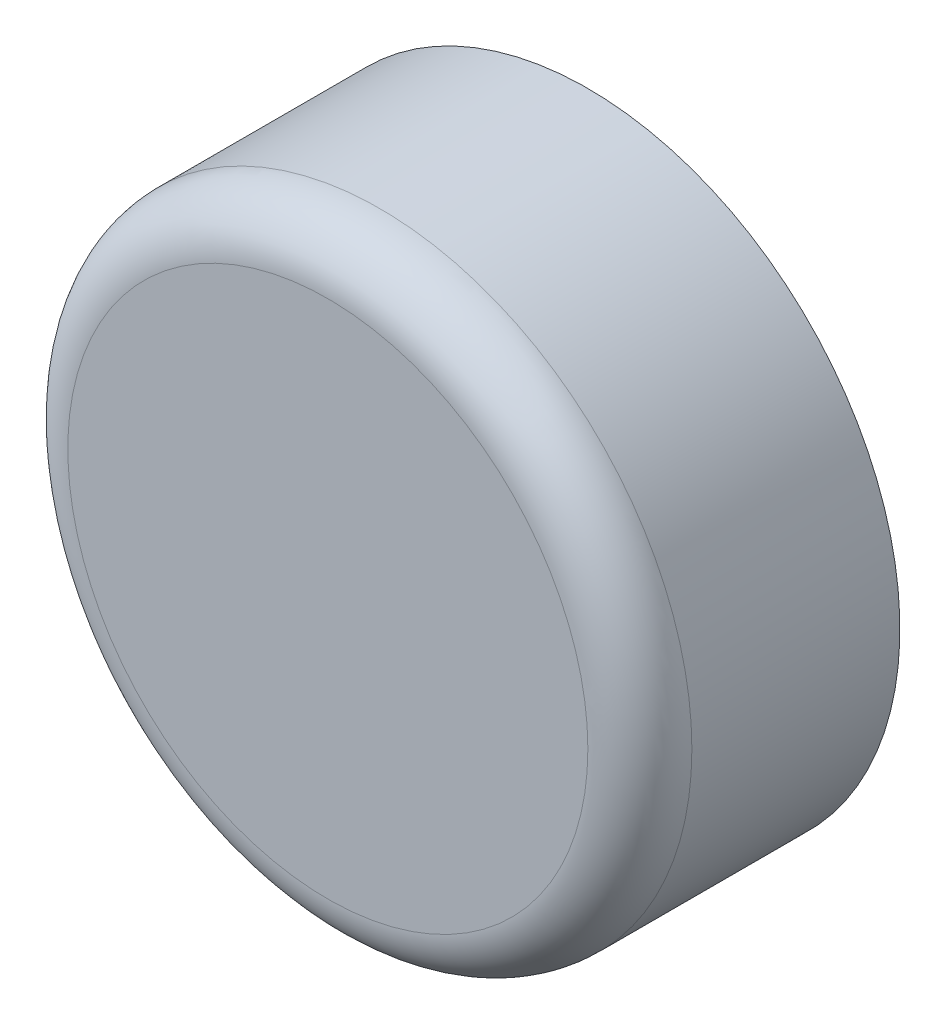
ISO-10303-21;
HEADER;
FILE_DESCRIPTION(('STEP AP214'),'2;1');
FILE_NAME('part.step','',(''),(''),'','','');
FILE_SCHEMA(('AUTOMOTIVE_DESIGN { 1 0 10303 214 1 1 1 1 }'));
ENDSEC;
DATA;
#1=APPLICATION_CONTEXT('core data for automotive mechanical design processes');
#2=APPLICATION_PROTOCOL_DEFINITION('international standard','automotive_design',2000,#1);
#3=PRODUCT_CONTEXT('',#1,'mechanical');
#4=PRODUCT('Part','Part','',(#3));
#5=PRODUCT_RELATED_PRODUCT_CATEGORY('part','',(#4));
#6=PRODUCT_DEFINITION_FORMATION('','',#4);
#7=PRODUCT_DEFINITION_CONTEXT('part definition',#1,'design');
#8=PRODUCT_DEFINITION('design','',#6,#7);
#9=PRODUCT_DEFINITION_SHAPE('','',#8);
#10=(LENGTH_UNIT() NAMED_UNIT(*) SI_UNIT(.MILLI.,.METRE.));
#11=(NAMED_UNIT(*) PLANE_ANGLE_UNIT() SI_UNIT($,.RADIAN.));
#12=(NAMED_UNIT(*) SI_UNIT($,.STERADIAN.) SOLID_ANGLE_UNIT());
#13=UNCERTAINTY_MEASURE_WITH_UNIT(LENGTH_MEASURE(1.E-05),#10,'distance_accuracy_value','');
#14=(GEOMETRIC_REPRESENTATION_CONTEXT(3) GLOBAL_UNCERTAINTY_ASSIGNED_CONTEXT((#13)) GLOBAL_UNIT_ASSIGNED_CONTEXT((#10,
#11,#12)) REPRESENTATION_CONTEXT('',''));
#15=CARTESIAN_POINT('',(0.,0.,0.));
#16=DIRECTION('',(0.,0.,1.));
#17=DIRECTION('',(1.,0.,0.));
#18=AXIS2_PLACEMENT_3D('',#15,#16,#17);
#19=CARTESIAN_POINT('',(0.176376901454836,7.26554646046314E-07,0.694786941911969));
#20=DIRECTION('',(0.,0.,-1.));
#21=DIRECTION('',(-1.,0.,0.));
#22=AXIS2_PLACEMENT_3D('',#19,#20,#21);
#23=CYLINDRICAL_SURFACE('',#22,19.65);
#24=CARTESIAN_POINT('',(0.176376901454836,7.26554646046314E-07,-2.58021305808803));
#25=DIRECTION('',(0.,0.,1.));
#26=DIRECTION('',(1.,0.,0.));
#27=AXIS2_PLACEMENT_3D('',#24,#25,#26);
#28=CIRCLE('',#27,19.65);
#29=CARTESIAN_POINT('',(19.8263769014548,7.26554646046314E-07,-2.58021305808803));
#30=VERTEX_POINT('',#29);
#31=EDGE_CURVE('E10',#30,#30,#28,.F.);
#32=ORIENTED_EDGE('',*,*,#31,.T.);
#33=EDGE_LOOP('',(#32));
#34=FACE_BOUND('',#33,.T.);
#35=CARTESIAN_POINT('',(-19.4736230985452,7.26554646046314E-07,-4.21771305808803));
#36=CARTESIAN_POINT('',(-19.4736199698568,-0.182601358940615,-4.21772037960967));
#37=CARTESIAN_POINT('',(-19.4710512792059,-0.365303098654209,-4.23303648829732));
#38=CARTESIAN_POINT('',(-19.4610516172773,-0.72558236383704,-4.29387077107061));
#39=CARTESIAN_POINT('',(-19.4536161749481,-0.903155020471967,-4.33941671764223));
#40=CARTESIAN_POINT('',(-19.4347169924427,-1.24791149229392,-4.45929729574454));
#41=CARTESIAN_POINT('',(-19.4232565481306,-1.41510367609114,-4.53360837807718));
#42=CARTESIAN_POINT('',(-19.3975674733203,-1.73462508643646,-4.70884816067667));
#43=CARTESIAN_POINT('',(-19.3833391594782,-1.88695601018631,-4.80977381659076));
#44=CARTESIAN_POINT('',(-19.3535395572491,-2.17390839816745,-5.03640421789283));
#45=CARTESIAN_POINT('',(-19.3379578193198,-2.30836717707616,-5.16231359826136));
#46=CARTESIAN_POINT('',(-19.3072875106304,-2.55435320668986,-5.43489689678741));
#47=CARTESIAN_POINT('',(-19.2921989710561,-2.66587900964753,-5.58157212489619));
#48=CARTESIAN_POINT('',(-19.2641222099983,-2.86348520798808,-5.89264102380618));
#49=CARTESIAN_POINT('',(-19.2511474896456,-2.94940473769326,-6.05713820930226));
#50=CARTESIAN_POINT('',(-19.2289123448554,-3.09233073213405,-6.39848258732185));
#51=CARTESIAN_POINT('',(-19.2196516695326,-3.14933914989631,-6.57532894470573));
#52=CARTESIAN_POINT('',(-19.2059971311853,-3.23231210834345,-6.9346272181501));
#53=CARTESIAN_POINT('',(-19.2015592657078,-3.25855750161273,-7.11701257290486));
#54=CARTESIAN_POINT('',(-19.1979196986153,-3.28013018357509,-7.48364822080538));
#55=CARTESIAN_POINT('',(-19.1987176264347,-3.27545966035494,-7.66789838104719));
#56=CARTESIAN_POINT('',(-19.2054193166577,-3.23556185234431,-8.03102855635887));
#57=CARTESIAN_POINT('',(-19.211270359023,-3.20065006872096,-8.20994435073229));
#58=CARTESIAN_POINT('',(-19.2273364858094,-3.10175588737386,-8.5593429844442));
#59=CARTESIAN_POINT('',(-19.237551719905,-3.03777249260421,-8.72982553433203));
#60=CARTESIAN_POINT('',(-19.2612521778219,-2.88223146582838,-9.05846281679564));
#61=CARTESIAN_POINT('',(-19.2747528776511,-2.79054282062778,-9.21655438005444));
#62=CARTESIAN_POINT('',(-19.3034923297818,-2.58228701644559,-9.51522782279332));
#63=CARTESIAN_POINT('',(-19.3187312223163,-2.46571784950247,-9.65580828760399));
#64=CARTESIAN_POINT('',(-19.3494616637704,-2.20929097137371,-9.91729523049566));
#65=CARTESIAN_POINT('',(-19.3649540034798,-2.06916256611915,-10.0379363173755));
#66=CARTESIAN_POINT('',(-19.3942711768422,-1.77051044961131,-10.2540329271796));
#67=CARTESIAN_POINT('',(-19.4080959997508,-1.61198661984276,-10.3494882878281));
#68=CARTESIAN_POINT('',(-19.4325400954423,-1.28079402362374,-10.5125279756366));
#69=CARTESIAN_POINT('',(-19.4431566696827,-1.10811350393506,-10.580088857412));
#70=CARTESIAN_POINT('',(-19.459966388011,-0.753640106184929,-10.6851754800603));
#71=CARTESIAN_POINT('',(-19.4661599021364,-0.571847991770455,-10.7227037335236));
#72=CARTESIAN_POINT('',(-19.4733758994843,-0.206599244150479,-10.7663000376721));
#73=CARTESIAN_POINT('',(-19.4744582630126,-0.0231872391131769,-10.7727324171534));
#74=CARTESIAN_POINT('',(-19.4714940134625,0.3420938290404,-10.7549256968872));
#75=CARTESIAN_POINT('',(-19.4674475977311,0.523962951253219,-10.7306877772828));
#76=CARTESIAN_POINT('',(-19.4547175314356,0.879870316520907,-10.6525315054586));
#77=CARTESIAN_POINT('',(-19.4460620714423,1.05394926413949,-10.598793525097));
#78=CARTESIAN_POINT('',(-19.4250805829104,1.39062714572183,-10.4633548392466));
#79=CARTESIAN_POINT('',(-19.4127543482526,1.55322543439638,-10.3816525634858));
#80=CARTESIAN_POINT('',(-19.3856502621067,1.86390892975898,-10.1917700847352));
#81=CARTESIAN_POINT('',(-19.3708517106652,2.01185320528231,-10.0833623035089));
#82=CARTESIAN_POINT('',(-19.3405070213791,2.28757982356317,-9.8434591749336));
#83=CARTESIAN_POINT('',(-19.3249608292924,2.41536070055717,-9.71196215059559));
#84=CARTESIAN_POINT('',(-19.2946793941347,2.64848376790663,-9.42797927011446));
#85=CARTESIAN_POINT('',(-19.2799542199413,2.75357980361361,-9.27529010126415));
#86=CARTESIAN_POINT('',(-19.2531701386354,2.93663075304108,-8.95421066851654));
#87=CARTESIAN_POINT('',(-19.24111114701,3.01458652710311,-8.78582090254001));
#88=CARTESIAN_POINT('',(-19.2211003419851,3.14077594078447,-8.43880850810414));
#89=CARTESIAN_POINT('',(-19.2131316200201,3.18913210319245,-8.26023145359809));
#90=CARTESIAN_POINT('',(-19.2021611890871,3.25513517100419,-7.89734568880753));
#91=CARTESIAN_POINT('',(-19.1991590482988,3.27278474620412,-7.71303747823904));
#92=CARTESIAN_POINT('',(-19.1984803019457,3.27679918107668,-7.34637929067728));
#93=CARTESIAN_POINT('',(-19.2007377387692,3.26355150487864,-7.1640335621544));
#94=CARTESIAN_POINT('',(-19.210179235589,3.20698531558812,-6.80420424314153));
#95=CARTESIAN_POINT('',(-19.2173632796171,3.16366689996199,-6.62672063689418));
#96=CARTESIAN_POINT('',(-19.2358234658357,3.04833730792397,-6.28180350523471));
#97=CARTESIAN_POINT('',(-19.2470948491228,2.97635949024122,-6.11435855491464));
#98=CARTESIAN_POINT('',(-19.2724643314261,2.80579410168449,-5.79385833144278));
#99=CARTESIAN_POINT('',(-19.2865625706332,2.70720521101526,-5.64080377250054));
#100=CARTESIAN_POINT('',(-19.3162063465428,2.48483346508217,-5.35147144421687));
#101=CARTESIAN_POINT('',(-19.3317670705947,2.36076556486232,-5.21541427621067));
#102=CARTESIAN_POINT('',(-19.3624613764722,2.09155855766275,-4.96591745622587));
#103=CARTESIAN_POINT('',(-19.3775948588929,1.9464145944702,-4.85248303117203));
#104=CARTESIAN_POINT('',(-19.4058506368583,1.63798433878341,-4.6507358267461));
#105=CARTESIAN_POINT('',(-19.4189583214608,1.47457967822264,-4.56260194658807));
#106=CARTESIAN_POINT('',(-19.4415433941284,1.13513284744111,-4.41517003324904));
#107=CARTESIAN_POINT('',(-19.4510243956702,0.959103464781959,-4.35584328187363));
#108=CARTESIAN_POINT('',(-19.4632189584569,0.65199206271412,-4.2805861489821));
#109=CARTESIAN_POINT('',(-19.4670996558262,0.522767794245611,-4.25704650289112));
#110=CARTESIAN_POINT('',(-19.4723028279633,0.262379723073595,-4.22560746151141));
#111=CARTESIAN_POINT('',(-19.4736253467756,0.131215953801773,-4.21770779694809));
#112=CARTESIAN_POINT('',(-19.4736230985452,7.26554646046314E-07,-4.21771305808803));
#113=B_SPLINE_CURVE_WITH_KNOTS('',3,(#35,#36,#37,#38,#39,#40,#41,#42,#43,#44,#45,#46,#47,#48,
#49,#50,#51,#52,#53,#54,#55,#56,#57,#58,#59,#60,#61,#62,#63,#64,#65,#66,#67,#68,#69,#70,#71,#72,
#73,#74,#75,#76,#77,#78,#79,#80,#81,#82,#83,#84,#85,#86,#87,#88,#89,#90,#91,#92,#93,#94,#95,#96,
#97,#98,#99,#100,#101,#102,#103,#104,#105,#106,#107,#108,#109,#110,#111,#112),.UNSPECIFIED.,.T.,
.F.,(4,2,2,2,2,2,2,2,2,2,2,2,2,2,2,2,2,2,2,2,2,2,2,2,2,2,2,2,2,2,2,2,2,2,2,2,2,2,4),(0.,
0.547326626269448,1.095156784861,1.6425393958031,2.18985942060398,2.74186263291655,
3.29390068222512,3.8493370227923,4.40473583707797,4.95502361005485,5.50527243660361,
6.04984883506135,6.59444391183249,7.1416556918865,7.68891165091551,8.24294928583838,
8.7969904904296,9.35149642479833,9.90595596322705,10.4539032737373,11.0018295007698,
11.546442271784,12.0910856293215,12.640541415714,13.1900371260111,13.7452250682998,
14.3003954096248,14.8532518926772,15.4060603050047,15.9519736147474,16.4978851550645,
17.0431631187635,17.5884681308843,18.1402431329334,18.6921454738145,19.2478592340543,
19.8030178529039,20.1963256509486,20.5896266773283),.UNSPECIFIED.);
#114=CARTESIAN_POINT('',(-19.4736230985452,7.26554646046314E-07,-4.21771305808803));
#115=VERTEX_POINT('',#114);
#116=EDGE_CURVE('E61',#115,#115,#113,.T.);
#117=ORIENTED_EDGE('',*,*,#116,.T.);
#118=EDGE_LOOP('',(#117));
#119=FACE_BOUND('',#118,.T.);
#120=CARTESIAN_POINT('',(0.176376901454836,7.26554646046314E-07,-15.680213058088));
#121=DIRECTION('',(0.,0.,-1.));
#122=DIRECTION('',(-1.,0.,0.));
#123=AXIS2_PLACEMENT_3D('',#120,#121,#122);
#124=CIRCLE('',#123,19.65);
#125=CARTESIAN_POINT('',(-19.4736230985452,7.26554646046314E-07,-15.680213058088));
#126=VERTEX_POINT('',#125);
#127=EDGE_CURVE('E51',#126,#126,#124,.T.);
#128=ORIENTED_EDGE('',*,*,#127,.F.);
#129=EDGE_LOOP('',(#128));
#130=FACE_BOUND('',#129,.T.);
#131=ADVANCED_FACE('F36',(#34,#119,#130),#23,.T.);
#132=CARTESIAN_POINT('',(0.176376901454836,7.26554646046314E-07,0.694786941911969));
#133=DIRECTION('',(0.,0.,1.));
#134=DIRECTION('',(1.,0.,0.));
#135=AXIS2_PLACEMENT_3D('',#132,#133,#134);
#136=PLANE('',#135);
#137=CARTESIAN_POINT('',(0.176376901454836,7.26554646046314E-07,0.694786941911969));
#138=DIRECTION('',(0.,0.,1.));
#139=DIRECTION('',(1.,0.,0.));
#140=AXIS2_PLACEMENT_3D('',#137,#138,#139);
#141=CIRCLE('',#140,16.375);
#142=CARTESIAN_POINT('',(16.5513769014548,7.26554646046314E-07,0.694786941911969));
#143=VERTEX_POINT('',#142);
#144=EDGE_CURVE('E43',#143,#143,#141,.T.);
#145=ORIENTED_EDGE('',*,*,#144,.T.);
#146=EDGE_LOOP('',(#145));
#147=FACE_BOUND('',#146,.T.);
#148=ADVANCED_FACE('F82',(#147),#136,.T.);
#149=CARTESIAN_POINT('',(0.176376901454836,7.26554646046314E-07,-15.680213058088));
#150=DIRECTION('',(0.,0.,1.));
#151=DIRECTION('',(1.,0.,0.));
#152=AXIS2_PLACEMENT_3D('',#149,#150,#151);
#153=CYLINDRICAL_SURFACE('',#152,6.55);
#154=CARTESIAN_POINT('',(-6.37362309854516,7.26554646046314E-07,-10.767713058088));
#155=CARTESIAN_POINT('',(-6.37362238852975,-0.0861260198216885,-10.7677121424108));
#156=CARTESIAN_POINT('',(-6.37191864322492,-0.172261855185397,-10.7643092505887));
#157=CARTESIAN_POINT('',(-6.36515560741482,-0.343877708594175,-10.7507492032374));
#158=CARTESIAN_POINT('',(-6.36009485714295,-0.429357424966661,-10.7405891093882));
#159=CARTESIAN_POINT('',(-6.34002135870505,-0.684068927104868,-10.7000757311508));
#160=CARTESIAN_POINT('',(-6.32011761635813,-0.85144785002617,-10.6596895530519));
#161=CARTESIAN_POINT('',(-6.26935765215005,-1.17554509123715,-10.5542029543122));
#162=CARTESIAN_POINT('',(-6.23854402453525,-1.33230208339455,-10.4891985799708));
#163=CARTESIAN_POINT('',(-6.16879698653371,-1.63248656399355,-10.33681994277));
#164=CARTESIAN_POINT('',(-6.12986421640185,-1.77591510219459,-10.2494474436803));
#165=CARTESIAN_POINT('',(-6.04469031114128,-2.05509126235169,-10.0487916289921));
#166=CARTESIAN_POINT('',(-5.99814952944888,-2.18984926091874,-9.93426054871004));
#167=CARTESIAN_POINT('',(-5.90398846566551,-2.43914778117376,-9.68526451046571));
#168=CARTESIAN_POINT('',(-5.85636739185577,-2.55367289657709,-9.55078450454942));
#169=CARTESIAN_POINT('',(-5.76115823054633,-2.76821337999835,-9.25304263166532));
#170=CARTESIAN_POINT('',(-5.71385909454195,-2.86641476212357,-9.0883574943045));
#171=CARTESIAN_POINT('',(-5.65074817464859,-2.99153745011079,-8.82896670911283));
#172=CARTESIAN_POINT('',(-5.63101216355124,-3.02955753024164,-8.74041063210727));
#173=CARTESIAN_POINT('',(-5.59489106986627,-3.09781412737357,-8.55970742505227));
#174=CARTESIAN_POINT('',(-5.57850400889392,-3.12805524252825,-8.46756245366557));
#175=CARTESIAN_POINT('',(-5.55061932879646,-3.17880466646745,-8.28592264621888));
#176=CARTESIAN_POINT('',(-5.53888933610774,-3.19978390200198,-8.19659483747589));
#177=CARTESIAN_POINT('',(-5.51947890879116,-3.23420979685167,-8.01610728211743));
#178=CARTESIAN_POINT('',(-5.51179632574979,-3.24766045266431,-7.92494853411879));
#179=CARTESIAN_POINT('',(-5.50081110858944,-3.26682686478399,-7.74160610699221));
#180=CARTESIAN_POINT('',(-5.49750583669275,-3.27254727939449,-7.64942307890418));
#181=CARTESIAN_POINT('',(-5.49540516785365,-3.27618321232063,-7.46488248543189));
#182=CARTESIAN_POINT('',(-5.49660934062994,-3.27409947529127,-7.37252493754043));
#183=CARTESIAN_POINT('',(-5.50612655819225,-3.25758690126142,-7.11854005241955));
#184=CARTESIAN_POINT('',(-5.51914060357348,-3.23499015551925,-6.95752985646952));
#185=CARTESIAN_POINT('',(-5.55736408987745,-3.16673083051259,-6.64209329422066));
#186=CARTESIAN_POINT('',(-5.58257741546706,-3.12106090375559,-6.48766904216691));
#187=CARTESIAN_POINT('',(-5.64288947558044,-3.00713531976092,-6.18524610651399));
#188=CARTESIAN_POINT('',(-5.67820479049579,-2.93837835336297,-6.0374808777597));
#189=CARTESIAN_POINT('',(-5.75475917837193,-2.78061106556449,-5.75488347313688));
#190=CARTESIAN_POINT('',(-5.79600090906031,-2.69159164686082,-5.62005714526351));
#191=CARTESIAN_POINT('',(-5.8860791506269,-2.48266551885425,-5.34915668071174));
#192=CARTESIAN_POINT('',(-5.93521559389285,-2.36027360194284,-5.21509199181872));
#193=CARTESIAN_POINT('',(-6.03130772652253,-2.09454381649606,-4.96855436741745));
#194=CARTESIAN_POINT('',(-6.07826236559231,-1.9511959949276,-4.85609175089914));
#195=CARTESIAN_POINT('',(-6.16736319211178,-1.63919082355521,-4.65104257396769));
#196=CARTESIAN_POINT('',(-6.20918483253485,-1.46966728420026,-4.55962152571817));
#197=CARTESIAN_POINT('',(-6.28054370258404,-1.11502613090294,-4.40734527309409));
#198=CARTESIAN_POINT('',(-6.31009068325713,-0.929921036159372,-4.346465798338));
#199=CARTESIAN_POINT('',(-6.35149502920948,-0.565809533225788,-4.26200611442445));
#200=CARTESIAN_POINT('',(-6.36461482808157,-0.387567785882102,-4.23575426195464));
#201=CARTESIAN_POINT('',(-6.37601428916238,-0.0287524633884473,-4.21291606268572));
#202=CARTESIAN_POINT('',(-6.3743009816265,0.151819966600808,-4.21631566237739));
#203=CARTESIAN_POINT('',(-6.35695964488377,0.495288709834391,-4.25113996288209));
#204=CARTESIAN_POINT('',(-6.3424203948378,0.658470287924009,-4.28037210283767));
#205=CARTESIAN_POINT('',(-6.30229920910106,0.977283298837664,-4.36259274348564));
#206=CARTESIAN_POINT('',(-6.27671605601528,1.13291389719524,-4.41558386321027));
#207=CARTESIAN_POINT('',(-6.21590733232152,1.43736091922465,-4.54520803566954));
#208=CARTESIAN_POINT('',(-6.1804269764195,1.58585527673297,-4.6224737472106));
#209=CARTESIAN_POINT('',(-6.1032382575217,1.86826168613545,-4.79774023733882));
#210=CARTESIAN_POINT('',(-6.06152724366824,2.00216748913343,-4.8957498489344));
#211=CARTESIAN_POINT('',(-5.97106734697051,2.26553990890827,-5.12082845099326));
#212=CARTESIAN_POINT('',(-5.92202957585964,2.3932792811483,-5.24980595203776));
#213=CARTESIAN_POINT('',(-5.82546642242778,2.62608017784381,-5.52746792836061));
#214=CARTESIAN_POINT('',(-5.77794210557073,2.73112601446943,-5.67616592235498));
#215=CARTESIAN_POINT('',(-5.68754964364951,2.92034414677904,-5.9981460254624));
#216=CARTESIAN_POINT('',(-5.64501844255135,3.00325922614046,-6.17226995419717));
#217=CARTESIAN_POINT('',(-5.57367396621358,3.13772198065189,-6.53480852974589));
#218=CARTESIAN_POINT('',(-5.54484302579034,3.18931007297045,-6.72320440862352));
#219=CARTESIAN_POINT('',(-5.50776225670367,3.25489775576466,-7.08959403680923));
#220=CARTESIAN_POINT('',(-5.49780240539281,3.27203029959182,-7.26685023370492));
#221=CARTESIAN_POINT('',(-5.4947884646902,3.27725769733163,-7.62190220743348));
#222=CARTESIAN_POINT('',(-5.50172704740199,3.2653651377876,-7.79969771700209));
#223=CARTESIAN_POINT('',(-5.52991307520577,3.21580882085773,-8.13292151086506));
#224=CARTESIAN_POINT('',(-5.54973442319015,3.18070807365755,-8.28886704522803));
#225=CARTESIAN_POINT('',(-5.5997738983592,3.08889990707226,-8.59248470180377));
#226=CARTESIAN_POINT('',(-5.6299953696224,3.03218553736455,-8.74015414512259));
#227=CARTESIAN_POINT('',(-5.69990738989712,2.89449775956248,-9.03400923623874));
#228=CARTESIAN_POINT('',(-5.74009770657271,2.81215050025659,-9.17942863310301));
#229=CARTESIAN_POINT('',(-5.82458051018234,2.62704336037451,-9.45533796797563));
#230=CARTESIAN_POINT('',(-5.86887512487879,2.52427285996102,-9.58582008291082));
#231=CARTESIAN_POINT('',(-5.9630129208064,2.28662416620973,-9.84462467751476));
#232=CARTESIAN_POINT('',(-6.01287632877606,2.14936196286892,-9.97075831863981));
#233=CARTESIAN_POINT('',(-6.10762445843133,1.85412794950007,-10.1987376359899));
#234=CARTESIAN_POINT('',(-6.15250648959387,1.69614504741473,-10.3005702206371));
#235=CARTESIAN_POINT('',(-6.2126176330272,1.44593866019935,-10.4327659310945));
#236=CARTESIAN_POINT('',(-6.23151567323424,1.35994782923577,-10.4735309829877));
#237=CARTESIAN_POINT('',(-6.26629968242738,1.18423764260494,-10.5475912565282));
#238=CARTESIAN_POINT('',(-6.28218713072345,1.09452014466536,-10.5808901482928));
#239=CARTESIAN_POINT('',(-6.31044496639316,0.912215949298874,-10.6395593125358));
#240=CARTESIAN_POINT('',(-6.32282301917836,0.819636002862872,-10.6649468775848));
#241=CARTESIAN_POINT('',(-6.34371985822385,0.632231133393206,-10.7075432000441));
#242=CARTESIAN_POINT('',(-6.35224100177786,0.537407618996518,-10.7247569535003));
#243=CARTESIAN_POINT('',(-6.36364340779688,0.368792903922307,-10.7477188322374));
#244=CARTESIAN_POINT('',(-6.36737915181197,0.295291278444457,-10.7552101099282));
#245=CARTESIAN_POINT('',(-6.37236933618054,0.147862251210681,-10.765207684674));
#246=CARTESIAN_POINT('',(-6.37362370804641,0.0739348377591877,-10.7677138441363));
#247=CARTESIAN_POINT('',(-6.37362309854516,7.26554646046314E-07,-10.767713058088));
#248=B_SPLINE_CURVE_WITH_KNOTS('',3,(#154,#155,#156,#157,#158,#159,#160,#161,#162,#163,#164,
#165,#166,#167,#168,#169,#170,#171,#172,#173,#174,#175,#176,#177,#178,#179,#180,#181,#182,#183,
#184,#185,#186,#187,#188,#189,#190,#191,#192,#193,#194,#195,#196,#197,#198,#199,#200,#201,#202,
#203,#204,#205,#206,#207,#208,#209,#210,#211,#212,#213,#214,#215,#216,#217,#218,#219,#220,#221,
#222,#223,#224,#225,#226,#227,#228,#229,#230,#231,#232,#233,#234,#235,#236,#237,#238,#239,#240,
#241,#242,#243,#244,#245,#246,#247),.UNSPECIFIED.,.T.,.F.,(4,2,2,2,2,2,2,2,2,2,2,2,2,2,2,2,2,2,
2,2,2,2,2,2,2,2,2,2,2,2,2,2,2,2,2,2,2,2,2,2,2,2,2,2,2,2,4),(0.,0.258302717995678,
0.51671783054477,1.03391857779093,1.54912194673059,2.06428470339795,2.61061364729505,
3.15735681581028,3.74649992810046,4.04127047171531,4.33586637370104,4.61298727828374,
4.88996093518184,5.16676761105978,5.44354787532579,5.93035550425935,6.41731825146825,
6.91562378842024,7.41415349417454,7.9758952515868,8.53790468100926,9.12601240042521,
9.71365202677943,10.2526211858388,10.7913349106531,11.2882946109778,11.7853091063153,
12.296534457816,12.8079779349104,13.3696456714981,13.9317004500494,14.5209742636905,
15.1094861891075,15.6415032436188,16.1732896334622,16.654415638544,17.1356964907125,
17.6493123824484,18.1631960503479,18.7395201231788,19.3161539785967,19.6068852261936,
19.8974732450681,20.1874215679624,20.4771924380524,20.6989221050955,20.9206578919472),.UNSPECIFIED.);
#249=CARTESIAN_POINT('',(-6.37362309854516,7.26554646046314E-07,-10.767713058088));
#250=VERTEX_POINT('',#249);
#251=EDGE_CURVE('E54',#250,#250,#248,.T.);
#252=ORIENTED_EDGE('',*,*,#251,.T.);
#253=EDGE_LOOP('',(#252));
#254=FACE_BOUND('',#253,.T.);
#255=CARTESIAN_POINT('',(0.176376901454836,7.26554646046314E-07,-15.680213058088));
#256=DIRECTION('',(0.,0.,-1.));
#257=DIRECTION('',(-1.,0.,0.));
#258=AXIS2_PLACEMENT_3D('',#255,#256,#257);
#259=CIRCLE('',#258,6.55);
#260=CARTESIAN_POINT('',(-6.37362309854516,7.26554646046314E-07,-15.680213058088));
#261=VERTEX_POINT('',#260);
#262=EDGE_CURVE('E47',#261,#261,#259,.F.);
#263=ORIENTED_EDGE('',*,*,#262,.F.);
#264=EDGE_LOOP('',(#263));
#265=FACE_BOUND('',#264,.T.);
#266=CARTESIAN_POINT('',(0.176376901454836,7.26554646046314E-07,-2.58021305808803));
#267=DIRECTION('',(0.,0.,-1.));
#268=DIRECTION('',(-1.,0.,0.));
#269=AXIS2_PLACEMENT_3D('',#266,#267,#268);
#270=CIRCLE('',#269,6.55);
#271=CARTESIAN_POINT('',(-6.37362309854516,7.26554646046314E-07,-2.58021305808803));
#272=VERTEX_POINT('',#271);
#273=EDGE_CURVE('E62',#272,#272,#270,.F.);
#274=ORIENTED_EDGE('',*,*,#273,.T.);
#275=EDGE_LOOP('',(#274));
#276=FACE_BOUND('',#275,.T.);
#277=ADVANCED_FACE('F63',(#254,#265,#276),#153,.F.);
#278=CARTESIAN_POINT('',(0.176376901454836,7.26554646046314E-07,-15.680213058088));
#279=DIRECTION('',(0.,0.,-1.));
#280=DIRECTION('',(-1.,0.,0.));
#281=AXIS2_PLACEMENT_3D('',#278,#279,#280);
#282=PLANE('',#281);
#283=ORIENTED_EDGE('',*,*,#127,.T.);
#284=EDGE_LOOP('',(#283));
#285=FACE_BOUND('',#284,.T.);
#286=ORIENTED_EDGE('',*,*,#262,.T.);
#287=EDGE_LOOP('',(#286));
#288=FACE_BOUND('',#287,.T.);
#289=ADVANCED_FACE('F72',(#285,#288),#282,.T.);
#290=CARTESIAN_POINT('',(0.176376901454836,7.26554647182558E-07,-14.861463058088));
#291=DIRECTION('',(0.,0.,-1.));
#292=DIRECTION('',(0.,1.,0.));
#293=AXIS2_PLACEMENT_3D('',#290,#291,#292);
#294=SPHERICAL_SURFACE('',#293,13.91875);
#295=ORIENTED_EDGE('',*,*,#273,.F.);
#296=EDGE_LOOP('',(#295));
#297=FACE_BOUND('',#296,.T.);
#298=ADVANCED_FACE('F70',(#297),#294,.F.);
#299=CARTESIAN_POINT('',(-34.5386230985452,7.26554646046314E-07,-7.49271305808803));
#300=DIRECTION('',(1.,0.,0.));
#301=DIRECTION('',(0.,0.,-1.));
#302=AXIS2_PLACEMENT_3D('',#299,#300,#301);
#303=CYLINDRICAL_SURFACE('',#302,3.275);
#304=ORIENTED_EDGE('',*,*,#251,.F.);
#305=EDGE_LOOP('',(#304));
#306=FACE_BOUND('',#305,.T.);
#307=ORIENTED_EDGE('',*,*,#116,.F.);
#308=EDGE_LOOP('',(#307));
#309=FACE_BOUND('',#308,.T.);
#310=ADVANCED_FACE('F67',(#306,#309),#303,.F.);
#311=CARTESIAN_POINT('',(0.176376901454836,7.26554646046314E-07,-2.58021305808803));
#312=DIRECTION('',(0.,0.,1.));
#313=DIRECTION('',(1.,0.,0.));
#314=AXIS2_PLACEMENT_3D('',#311,#312,#313);
#315=TOROIDAL_SURFACE('',#314,16.375,3.275);
#316=ORIENTED_EDGE('',*,*,#31,.F.);
#317=EDGE_LOOP('',(#316));
#318=FACE_BOUND('',#317,.T.);
#319=ORIENTED_EDGE('',*,*,#144,.F.);
#320=EDGE_LOOP('',(#319));
#321=FACE_BOUND('',#320,.T.);
#322=ADVANCED_FACE('F38',(#318,#321),#315,.T.);
#323=CLOSED_SHELL('',(#131,#148,#277,#289,#298,#310,#322));
#324=MANIFOLD_SOLID_BREP('B2',#323);
#325=ADVANCED_BREP_SHAPE_REPRESENTATION('',(#18,#324),#14);
#326=SHAPE_DEFINITION_REPRESENTATION(#9,#325);
ENDSEC;
END-ISO-10303-21;
